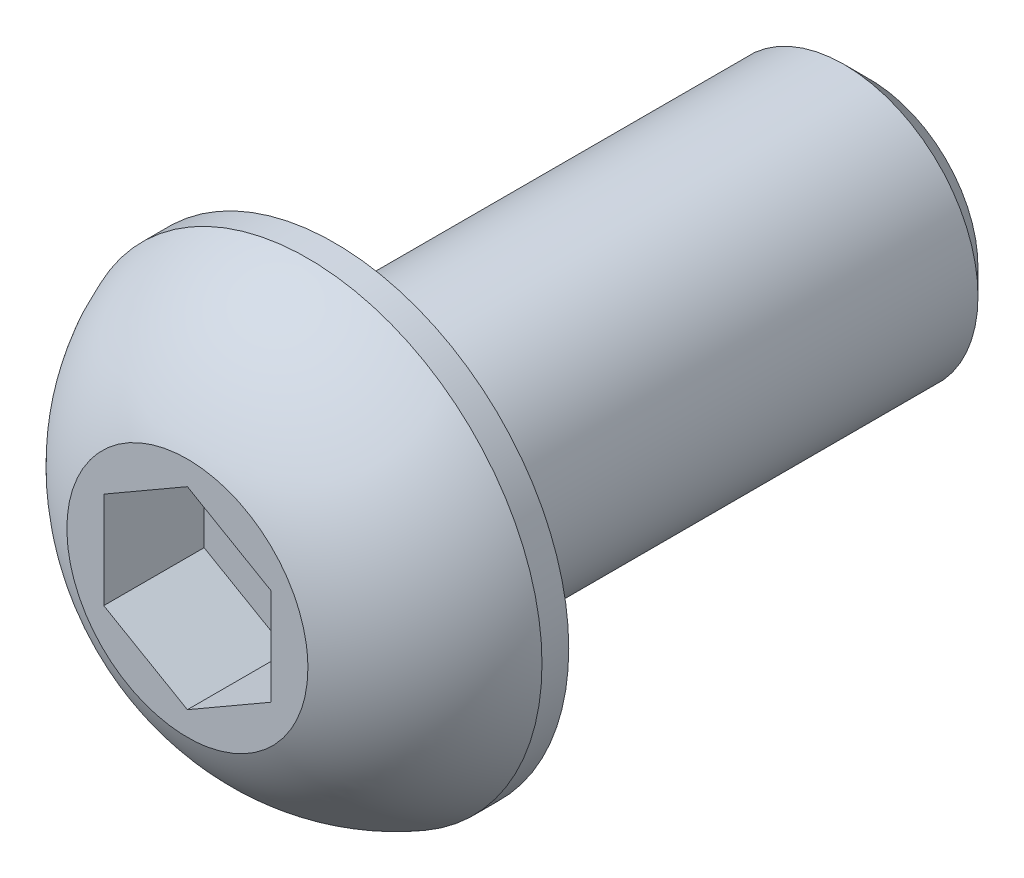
ISO-10303-21;
HEADER;
FILE_DESCRIPTION(('STEP AP214'),'2;1');
FILE_NAME('part.step','',(''),(''),'','','');
FILE_SCHEMA(('AUTOMOTIVE_DESIGN { 1 0 10303 214 1 1 1 1 }'));
ENDSEC;
DATA;
#1=APPLICATION_CONTEXT('core data for automotive mechanical design processes');
#2=APPLICATION_PROTOCOL_DEFINITION('international standard','automotive_design',2000,#1);
#3=PRODUCT_CONTEXT('',#1,'mechanical');
#4=PRODUCT('Part','Part','',(#3));
#5=PRODUCT_RELATED_PRODUCT_CATEGORY('part','',(#4));
#6=PRODUCT_DEFINITION_FORMATION('','',#4);
#7=PRODUCT_DEFINITION_CONTEXT('part definition',#1,'design');
#8=PRODUCT_DEFINITION('design','',#6,#7);
#9=PRODUCT_DEFINITION_SHAPE('','',#8);
#10=(LENGTH_UNIT() NAMED_UNIT(*) SI_UNIT(.MILLI.,.METRE.));
#11=(NAMED_UNIT(*) PLANE_ANGLE_UNIT() SI_UNIT($,.RADIAN.));
#12=(NAMED_UNIT(*) SI_UNIT($,.STERADIAN.) SOLID_ANGLE_UNIT());
#13=UNCERTAINTY_MEASURE_WITH_UNIT(LENGTH_MEASURE(1.E-05),#10,'distance_accuracy_value','');
#14=(GEOMETRIC_REPRESENTATION_CONTEXT(3) GLOBAL_UNCERTAINTY_ASSIGNED_CONTEXT((#13)) GLOBAL_UNIT_ASSIGNED_CONTEXT((#10,
#11,#12)) REPRESENTATION_CONTEXT('',''));
#15=CARTESIAN_POINT('',(0.,0.,0.));
#16=DIRECTION('',(0.,0.,1.));
#17=DIRECTION('',(1.,0.,0.));
#18=AXIS2_PLACEMENT_3D('',#15,#16,#17);
#19=CARTESIAN_POINT('',(0.,0.,1.4));
#20=DIRECTION('',(0.,0.,-1.));
#21=DIRECTION('',(-1.,0.,0.));
#22=AXIS2_PLACEMENT_3D('',#19,#20,#21);
#23=PLANE('',#22);
#24=DIRECTION('',(-0.866025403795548,0.499999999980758,0.));
#25=VECTOR('',#24,1.);
#26=CARTESIAN_POINT('',(1.25,2.16506350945,1.4));
#27=LINE('',#26,#25);
#28=CARTESIAN_POINT('',(2.5,1.443375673,1.4));
#29=VERTEX_POINT('',#28);
#30=CARTESIAN_POINT('',(0.,2.8867513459,1.4));
#31=VERTEX_POINT('',#30);
#32=EDGE_CURVE('E246',#29,#31,#27,.T.);
#33=ORIENTED_EDGE('',*,*,#32,.T.);
#34=DIRECTION('',(-0.866025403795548,-0.499999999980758,0.));
#35=VECTOR('',#34,1.);
#36=CARTESIAN_POINT('',(-1.25,2.16506350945,1.4));
#37=LINE('',#36,#35);
#38=CARTESIAN_POINT('',(-2.5,1.443375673,1.4));
#39=VERTEX_POINT('',#38);
#40=EDGE_CURVE('E251',#31,#39,#37,.T.);
#41=ORIENTED_EDGE('',*,*,#40,.T.);
#42=DIRECTION('',(0.,1.,0.));
#43=VECTOR('',#42,1.);
#44=CARTESIAN_POINT('',(-2.5,0.,1.4));
#45=LINE('',#44,#43);
#46=CARTESIAN_POINT('',(-2.5,-1.443375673,1.4));
#47=VERTEX_POINT('',#46);
#48=EDGE_CURVE('E256',#39,#47,#45,.F.);
#49=ORIENTED_EDGE('',*,*,#48,.T.);
#50=DIRECTION('',(0.866025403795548,-0.499999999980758,0.));
#51=VECTOR('',#50,1.);
#52=CARTESIAN_POINT('',(-1.25,-2.16506350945,1.4));
#53=LINE('',#52,#51);
#54=CARTESIAN_POINT('',(0.,-2.8867513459,1.4));
#55=VERTEX_POINT('',#54);
#56=EDGE_CURVE('E112',#47,#55,#53,.T.);
#57=ORIENTED_EDGE('',*,*,#56,.T.);
#58=DIRECTION('',(0.866025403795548,0.499999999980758,0.));
#59=VECTOR('',#58,1.);
#60=CARTESIAN_POINT('',(1.25,-2.16506350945,1.4));
#61=LINE('',#60,#59);
#62=CARTESIAN_POINT('',(2.5,-1.443375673,1.4));
#63=VERTEX_POINT('',#62);
#64=EDGE_CURVE('E96',#55,#63,#61,.T.);
#65=ORIENTED_EDGE('',*,*,#64,.T.);
#66=DIRECTION('',(0.,1.,0.));
#67=VECTOR('',#66,1.);
#68=CARTESIAN_POINT('',(2.5,0.7216878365,1.4));
#69=LINE('',#68,#67);
#70=EDGE_CURVE('E101',#63,#29,#69,.T.);
#71=ORIENTED_EDGE('',*,*,#70,.T.);
#72=EDGE_LOOP('',(#33,#41,#49,#57,#65,#71));
#73=FACE_BOUND('',#72,.T.);
#74=ADVANCED_FACE('F41',(#73),#23,.F.);
#75=CARTESIAN_POINT('',(2.5,0.7216878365,4.4));
#76=DIRECTION('',(1.,0.,0.));
#77=DIRECTION('',(0.,0.,-1.));
#78=AXIS2_PLACEMENT_3D('',#75,#76,#77);
#79=PLANE('',#78);
#80=DIRECTION('',(0.,0.,1.));
#81=VECTOR('',#80,1.);
#82=CARTESIAN_POINT('',(2.5,-1.443375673,4.4));
#83=LINE('',#82,#81);
#84=CARTESIAN_POINT('',(2.5,-1.443375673,4.39999999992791));
#85=VERTEX_POINT('',#84);
#86=EDGE_CURVE('E103',#63,#85,#83,.T.);
#87=ORIENTED_EDGE('',*,*,#86,.T.);
#88=DIRECTION('',(0.,1.,0.));
#89=VECTOR('',#88,1.);
#90=CARTESIAN_POINT('',(2.5,0.,4.39999999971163));
#91=LINE('',#90,#89);
#92=CARTESIAN_POINT('',(2.5,1.443375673,4.39999999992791));
#93=VERTEX_POINT('',#92);
#94=EDGE_CURVE('E244',#93,#85,#91,.F.);
#95=ORIENTED_EDGE('',*,*,#94,.F.);
#96=DIRECTION('',(0.,0.,1.));
#97=VECTOR('',#96,1.);
#98=CARTESIAN_POINT('',(2.5,1.443375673,4.4));
#99=LINE('',#98,#97);
#100=EDGE_CURVE('E106',#93,#29,#99,.F.);
#101=ORIENTED_EDGE('',*,*,#100,.T.);
#102=ORIENTED_EDGE('',*,*,#70,.F.);
#103=EDGE_LOOP('',(#87,#95,#101,#102));
#104=FACE_BOUND('',#103,.T.);
#105=ADVANCED_FACE('F102',(#104),#79,.F.);
#106=CARTESIAN_POINT('',(1.25,-2.16506350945,4.4));
#107=DIRECTION('',(0.499999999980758,-0.866025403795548,0.));
#108=DIRECTION('',(0.866025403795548,0.499999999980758,0.));
#109=AXIS2_PLACEMENT_3D('',#106,#107,#108);
#110=PLANE('',#109);
#111=DIRECTION('',(0.,0.,1.));
#112=VECTOR('',#111,1.);
#113=CARTESIAN_POINT('',(0.,-2.8867513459,4.4));
#114=LINE('',#113,#112);
#115=CARTESIAN_POINT('',(0.,-2.8867513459,4.39999999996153));
#116=VERTEX_POINT('',#115);
#117=EDGE_CURVE('E114',#55,#116,#114,.T.);
#118=ORIENTED_EDGE('',*,*,#117,.T.);
#119=DIRECTION('',(-0.866025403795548,-0.499999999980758,4.65924845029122E-11));
#120=VECTOR('',#119,1.);
#121=CARTESIAN_POINT('',(2.5,-1.443375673,4.39999999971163));
#122=LINE('',#121,#120);
#123=EDGE_CURVE('E118',#85,#116,#122,.T.);
#124=ORIENTED_EDGE('',*,*,#123,.F.);
#125=ORIENTED_EDGE('',*,*,#86,.F.);
#126=ORIENTED_EDGE('',*,*,#64,.F.);
#127=EDGE_LOOP('',(#118,#124,#125,#126));
#128=FACE_BOUND('',#127,.T.);
#129=ADVANCED_FACE('F116',(#128),#110,.F.);
#130=CARTESIAN_POINT('',(-1.25,-2.16506350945,4.4));
#131=DIRECTION('',(-0.499999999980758,-0.866025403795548,0.));
#132=DIRECTION('',(0.866025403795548,-0.499999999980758,0.));
#133=AXIS2_PLACEMENT_3D('',#130,#131,#132);
#134=PLANE('',#133);
#135=DIRECTION('',(0.,0.,1.));
#136=VECTOR('',#135,1.);
#137=CARTESIAN_POINT('',(-2.5,-1.443375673,4.4));
#138=LINE('',#137,#136);
#139=CARTESIAN_POINT('',(-2.5,-1.443375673,4.39999999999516));
#140=VERTEX_POINT('',#139);
#141=EDGE_CURVE('E258',#47,#140,#138,.T.);
#142=ORIENTED_EDGE('',*,*,#141,.T.);
#143=DIRECTION('',(-0.866025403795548,0.499999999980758,4.65924845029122E-11));
#144=VECTOR('',#143,1.);
#145=CARTESIAN_POINT('',(0.,-2.8867513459,4.39999999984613));
#146=LINE('',#145,#144);
#147=EDGE_CURVE('E240',#116,#140,#146,.T.);
#148=ORIENTED_EDGE('',*,*,#147,.F.);
#149=ORIENTED_EDGE('',*,*,#117,.F.);
#150=ORIENTED_EDGE('',*,*,#56,.F.);
#151=EDGE_LOOP('',(#142,#148,#149,#150));
#152=FACE_BOUND('',#151,.T.);
#153=ADVANCED_FACE('F158',(#152),#134,.F.);
#154=CARTESIAN_POINT('',(-2.5,0.,4.4));
#155=DIRECTION('',(-1.,0.,0.));
#156=DIRECTION('',(0.,0.,1.));
#157=AXIS2_PLACEMENT_3D('',#154,#155,#156);
#158=PLANE('',#157);
#159=DIRECTION('',(0.,0.,1.));
#160=VECTOR('',#159,1.);
#161=CARTESIAN_POINT('',(-2.5,1.443375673,4.4));
#162=LINE('',#161,#160);
#163=CARTESIAN_POINT('',(-2.5,1.443375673,4.39999999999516));
#164=VERTEX_POINT('',#163);
#165=EDGE_CURVE('E254',#39,#164,#162,.T.);
#166=ORIENTED_EDGE('',*,*,#165,.T.);
#167=DIRECTION('',(0.,1.,0.));
#168=VECTOR('',#167,1.);
#169=CARTESIAN_POINT('',(-2.5,0.,4.39999999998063));
#170=LINE('',#169,#168);
#171=EDGE_CURVE('E237',#140,#164,#170,.T.);
#172=ORIENTED_EDGE('',*,*,#171,.F.);
#173=ORIENTED_EDGE('',*,*,#141,.F.);
#174=ORIENTED_EDGE('',*,*,#48,.F.);
#175=EDGE_LOOP('',(#166,#172,#173,#174));
#176=FACE_BOUND('',#175,.T.);
#177=ADVANCED_FACE('F154',(#176),#158,.F.);
#178=CARTESIAN_POINT('',(-1.25,2.16506350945,4.4));
#179=DIRECTION('',(-0.499999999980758,0.866025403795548,0.));
#180=DIRECTION('',(-0.866025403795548,-0.499999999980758,0.));
#181=AXIS2_PLACEMENT_3D('',#178,#179,#180);
#182=PLANE('',#181);
#183=DIRECTION('',(0.,0.,1.));
#184=VECTOR('',#183,1.);
#185=CARTESIAN_POINT('',(0.,2.8867513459,4.4));
#186=LINE('',#185,#184);
#187=CARTESIAN_POINT('',(0.,2.8867513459,4.39999999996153));
#188=VERTEX_POINT('',#187);
#189=EDGE_CURVE('E249',#31,#188,#186,.T.);
#190=ORIENTED_EDGE('',*,*,#189,.T.);
#191=DIRECTION('',(0.866025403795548,0.499999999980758,-4.65924845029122E-11));
#192=VECTOR('',#191,1.);
#193=CARTESIAN_POINT('',(-2.5,1.443375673,4.39999999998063));
#194=LINE('',#193,#192);
#195=EDGE_CURVE('E234',#164,#188,#194,.T.);
#196=ORIENTED_EDGE('',*,*,#195,.F.);
#197=ORIENTED_EDGE('',*,*,#165,.F.);
#198=ORIENTED_EDGE('',*,*,#40,.F.);
#199=EDGE_LOOP('',(#190,#196,#197,#198));
#200=FACE_BOUND('',#199,.T.);
#201=ADVANCED_FACE('F150',(#200),#182,.F.);
#202=CARTESIAN_POINT('',(1.25,2.16506350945,4.4));
#203=DIRECTION('',(0.499999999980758,0.866025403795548,0.));
#204=DIRECTION('',(-0.866025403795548,0.499999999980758,0.));
#205=AXIS2_PLACEMENT_3D('',#202,#203,#204);
#206=PLANE('',#205);
#207=ORIENTED_EDGE('',*,*,#100,.F.);
#208=DIRECTION('',(0.866025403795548,-0.499999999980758,-4.65924845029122E-11));
#209=VECTOR('',#208,1.);
#210=CARTESIAN_POINT('',(0.,2.8867513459,4.39999999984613));
#211=LINE('',#210,#209);
#212=EDGE_CURVE('E136',#188,#93,#211,.T.);
#213=ORIENTED_EDGE('',*,*,#212,.F.);
#214=ORIENTED_EDGE('',*,*,#189,.F.);
#215=ORIENTED_EDGE('',*,*,#32,.F.);
#216=EDGE_LOOP('',(#207,#213,#214,#215));
#217=FACE_BOUND('',#216,.T.);
#218=ADVANCED_FACE('F146',(#217),#206,.F.);
#219=CARTESIAN_POINT('',(-3.23151399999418,0.,4.40000000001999));
#220=DIRECTION('',(5.38003067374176E-11,0.,1.));
#221=DIRECTION('',(1.,0.,-5.38003067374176E-11));
#222=AXIS2_PLACEMENT_3D('',#219,#220,#221);
#223=PLANE('',#222);
#224=CARTESIAN_POINT('',(3.60302800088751,0.,4.39999999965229));
#225=CARTESIAN_POINT('',(3.60302739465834,-0.101161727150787,4.39999999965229));
#226=CARTESIAN_POINT('',(3.59876373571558,-0.202342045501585,4.39999999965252));
#227=CARTESIAN_POINT('',(3.5817368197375,-0.404003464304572,4.39999999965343));
#228=CARTESIAN_POINT('',(3.56897105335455,-0.504484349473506,4.39999999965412));
#229=CARTESIAN_POINT('',(3.53499735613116,-0.704182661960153,4.39999999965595));
#230=CARTESIAN_POINT('',(3.51377602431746,-0.803397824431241,4.39999999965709));
#231=CARTESIAN_POINT('',(3.46303747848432,-0.999742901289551,4.39999999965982));
#232=CARTESIAN_POINT('',(3.43351353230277,-1.0968710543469,4.39999999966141));
#233=CARTESIAN_POINT('',(3.33289595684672,-1.38366869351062,4.39999999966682));
#234=CARTESIAN_POINT('',(3.2496739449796,-1.56923401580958,4.3999999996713));
#235=CARTESIAN_POINT('',(3.05321325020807,-1.92373837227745,4.39999999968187));
#236=CARTESIAN_POINT('',(2.93997342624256,-2.09267677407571,4.39999999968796));
#237=CARTESIAN_POINT('',(2.7501783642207,-2.3299437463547,4.39999999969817));
#238=CARTESIAN_POINT('',(2.68354067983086,-2.40638732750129,4.39999999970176));
#239=CARTESIAN_POINT('',(2.54411499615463,-2.55333638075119,4.39999999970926));
#240=CARTESIAN_POINT('',(2.47133298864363,-2.62384750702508,4.39999999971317));
#241=CARTESIAN_POINT('',(2.32005283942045,-2.75851860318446,4.39999999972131));
#242=CARTESIAN_POINT('',(2.2415521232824,-2.82267568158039,4.39999999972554));
#243=CARTESIAN_POINT('',(2.07943216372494,-2.94415515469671,4.39999999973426));
#244=CARTESIAN_POINT('',(1.9958117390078,-3.00147596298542,4.39999999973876));
#245=CARTESIAN_POINT('',(1.73818269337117,-3.16250597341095,4.39999999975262));
#246=CARTESIAN_POINT('',(1.5572464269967,-3.25542481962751,4.39999999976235));
#247=CARTESIAN_POINT('',(1.18243980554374,-3.40951047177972,4.39999999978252));
#248=CARTESIAN_POINT('',(0.988569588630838,-3.47067761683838,4.39999999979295));
#249=CARTESIAN_POINT('',(0.593286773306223,-3.55961210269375,4.39999999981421));
#250=CARTESIAN_POINT('',(0.391874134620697,-3.58737926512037,4.39999999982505));
#251=CARTESIAN_POINT('',(-0.0127538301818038,-3.60869681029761,4.39999999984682));
#252=CARTESIAN_POINT('',(-0.21596915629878,-3.60224719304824,4.39999999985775));
#253=CARTESIAN_POINT('',(-0.618408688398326,-3.55534015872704,4.3999999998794));
#254=CARTESIAN_POINT('',(-0.817632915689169,-3.51488292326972,4.39999999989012));
#255=CARTESIAN_POINT('',(-1.20655549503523,-3.40103381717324,4.39999999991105));
#256=CARTESIAN_POINT('',(-1.39625374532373,-3.3276415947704,4.39999999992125));
#257=CARTESIAN_POINT('',(-1.66937712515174,-3.19457390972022,4.39999999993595));
#258=CARTESIAN_POINT('',(-1.75855773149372,-3.14635700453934,4.39999999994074));
#259=CARTESIAN_POINT('',(-1.93254490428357,-3.04258510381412,4.3999999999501));
#260=CARTESIAN_POINT('',(-2.01735247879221,-2.98703181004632,4.39999999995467));
#261=CARTESIAN_POINT('',(-2.18194598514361,-2.86900229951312,4.39999999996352));
#262=CARTESIAN_POINT('',(-2.26173417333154,-2.80652922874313,4.39999999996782));
#263=CARTESIAN_POINT('',(-2.41582896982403,-2.67504409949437,4.39999999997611));
#264=CARTESIAN_POINT('',(-2.49013021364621,-2.60602578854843,4.3999999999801));
#265=CARTESIAN_POINT('',(-2.70380588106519,-2.39001539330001,4.3999999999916));
#266=CARTESIAN_POINT('',(-2.83417035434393,-2.23391111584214,4.39999999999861));
#267=CARTESIAN_POINT('',(-3.0667937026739,-1.90201275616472,4.40000000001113));
#268=CARTESIAN_POINT('',(-3.16905364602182,-1.7262194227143,4.40000000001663));
#269=CARTESIAN_POINT('',(-3.29925003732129,-1.45158205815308,4.40000000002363));
#270=CARTESIAN_POINT('',(-3.3388164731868,-1.35809388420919,4.40000000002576));
#271=CARTESIAN_POINT('',(-3.40990547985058,-1.16816720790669,4.40000000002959));
#272=CARTESIAN_POINT('',(-3.44143456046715,-1.07173116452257,4.40000000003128));
#273=CARTESIAN_POINT('',(-3.49620387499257,-0.876708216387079,4.40000000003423));
#274=CARTESIAN_POINT('',(-3.51945719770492,-0.778124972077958,4.40000000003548));
#275=CARTESIAN_POINT('',(-3.5575798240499,-0.579369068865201,4.40000000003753));
#276=CARTESIAN_POINT('',(-3.57245160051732,-0.479196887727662,4.40000000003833));
#277=CARTESIAN_POINT('',(-3.58972538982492,-0.3157245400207,4.40000000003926));
#278=CARTESIAN_POINT('',(-3.59471229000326,-0.252686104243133,4.40000000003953));
#279=CARTESIAN_POINT('',(-3.60136378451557,-0.12643419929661,4.40000000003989));
#280=CARTESIAN_POINT('',(-3.60302837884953,-0.0632207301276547,4.40000000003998));
#281=CARTESIAN_POINT('',(-3.60302739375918,0.101161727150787,4.40000000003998));
#282=CARTESIAN_POINT('',(-3.59876373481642,0.202342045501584,4.40000000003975));
#283=CARTESIAN_POINT('',(-3.58173681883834,0.40400346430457,4.40000000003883));
#284=CARTESIAN_POINT('',(-3.56897105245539,0.504484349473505,4.40000000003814));
#285=CARTESIAN_POINT('',(-3.534997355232,0.704182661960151,4.40000000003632));
#286=CARTESIAN_POINT('',(-3.5137760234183,0.803397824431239,4.40000000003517));
#287=CARTESIAN_POINT('',(-3.46303747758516,0.99974290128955,4.40000000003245));
#288=CARTESIAN_POINT('',(-3.43351353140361,1.0968710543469,4.40000000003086));
#289=CARTESIAN_POINT('',(-3.33289595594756,1.38366869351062,4.40000000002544));
#290=CARTESIAN_POINT('',(-3.24967394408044,1.56923401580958,4.40000000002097));
#291=CARTESIAN_POINT('',(-3.05321324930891,1.92373837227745,4.4000000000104));
#292=CARTESIAN_POINT('',(-2.93997342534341,2.09267677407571,4.4000000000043));
#293=CARTESIAN_POINT('',(-2.75017836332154,2.3299437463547,4.39999999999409));
#294=CARTESIAN_POINT('',(-2.6835406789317,2.40638732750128,4.39999999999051));
#295=CARTESIAN_POINT('',(-2.54411499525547,2.55333638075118,4.39999999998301));
#296=CARTESIAN_POINT('',(-2.47133298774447,2.62384750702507,4.39999999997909));
#297=CARTESIAN_POINT('',(-2.3200528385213,2.75851860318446,4.39999999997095));
#298=CARTESIAN_POINT('',(-2.24155212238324,2.82267568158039,4.39999999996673));
#299=CARTESIAN_POINT('',(-2.07943216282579,2.94415515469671,4.39999999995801));
#300=CARTESIAN_POINT('',(-1.99581173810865,3.00147596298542,4.39999999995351));
#301=CARTESIAN_POINT('',(-1.73818269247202,3.16250597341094,4.39999999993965));
#302=CARTESIAN_POINT('',(-1.55724642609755,3.2554248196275,4.39999999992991));
#303=CARTESIAN_POINT('',(-1.18243980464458,3.40951047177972,4.39999999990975));
#304=CARTESIAN_POINT('',(-0.988569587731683,3.47067761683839,4.39999999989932));
#305=CARTESIAN_POINT('',(-0.593286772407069,3.55961210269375,4.39999999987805));
#306=CARTESIAN_POINT('',(-0.391874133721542,3.58737926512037,4.39999999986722));
#307=CARTESIAN_POINT('',(0.0127538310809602,3.60869681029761,4.39999999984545));
#308=CARTESIAN_POINT('',(0.215969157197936,3.60224719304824,4.39999999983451));
#309=CARTESIAN_POINT('',(0.618408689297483,3.55534015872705,4.39999999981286));
#310=CARTESIAN_POINT('',(0.817632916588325,3.51488292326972,4.39999999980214));
#311=CARTESIAN_POINT('',(1.20655549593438,3.40103381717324,4.39999999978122));
#312=CARTESIAN_POINT('',(1.39625374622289,3.32764159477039,4.39999999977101));
#313=CARTESIAN_POINT('',(1.66937712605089,3.19457390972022,4.39999999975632));
#314=CARTESIAN_POINT('',(1.75855773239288,3.14635700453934,4.39999999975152));
#315=CARTESIAN_POINT('',(1.93254490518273,3.04258510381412,4.39999999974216));
#316=CARTESIAN_POINT('',(2.01735247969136,2.98703181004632,4.3999999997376));
#317=CARTESIAN_POINT('',(2.18194598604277,2.86900229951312,4.39999999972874));
#318=CARTESIAN_POINT('',(2.2617341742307,2.80652922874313,4.39999999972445));
#319=CARTESIAN_POINT('',(2.41582897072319,2.67504409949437,4.39999999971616));
#320=CARTESIAN_POINT('',(2.49013021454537,2.60602578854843,4.39999999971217));
#321=CARTESIAN_POINT('',(2.70380588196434,2.39001539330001,4.39999999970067));
#322=CARTESIAN_POINT('',(2.83417035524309,2.23391111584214,4.39999999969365));
#323=CARTESIAN_POINT('',(3.06679370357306,1.90201275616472,4.39999999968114));
#324=CARTESIAN_POINT('',(3.16905364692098,1.7262194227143,4.39999999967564));
#325=CARTESIAN_POINT('',(3.29925003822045,1.45158205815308,4.39999999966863));
#326=CARTESIAN_POINT('',(3.33881647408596,1.35809388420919,4.3999999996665));
#327=CARTESIAN_POINT('',(3.40990548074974,1.16816720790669,4.39999999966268));
#328=CARTESIAN_POINT('',(3.44143456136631,1.07173116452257,4.39999999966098));
#329=CARTESIAN_POINT('',(3.49620387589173,0.876708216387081,4.39999999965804));
#330=CARTESIAN_POINT('',(3.51945719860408,0.77812497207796,4.39999999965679));
#331=CARTESIAN_POINT('',(3.55757982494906,0.579369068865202,4.39999999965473));
#332=CARTESIAN_POINT('',(3.57245160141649,0.479196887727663,4.39999999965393));
#333=CARTESIAN_POINT('',(3.58972539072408,0.3157245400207,4.399999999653));
#334=CARTESIAN_POINT('',(3.59471229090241,0.252686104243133,4.39999999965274));
#335=CARTESIAN_POINT('',(3.60136378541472,0.12643419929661,4.39999999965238));
#336=CARTESIAN_POINT('',(3.60302837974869,0.0632207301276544,4.39999999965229));
#337=CARTESIAN_POINT('',(3.60302800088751,0.,4.39999999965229));
#338=B_SPLINE_CURVE_WITH_KNOTS('',3,(#224,#225,#226,#227,#228,#229,#230,#231,#232,#233,#234,
#235,#236,#237,#238,#239,#240,#241,#242,#243,#244,#245,#246,#247,#248,#249,#250,#251,#252,#253,
#254,#255,#256,#257,#258,#259,#260,#261,#262,#263,#264,#265,#266,#267,#268,#269,#270,#271,#272,
#273,#274,#275,#276,#277,#278,#279,#280,#281,#282,#283,#284,#285,#286,#287,#288,#289,#290,#291,
#292,#293,#294,#295,#296,#297,#298,#299,#300,#301,#302,#303,#304,#305,#306,#307,#308,#309,#310,
#311,#312,#313,#314,#315,#316,#317,#318,#319,#320,#321,#322,#323,#324,#325,#326,#327,#328,#329,
#330,#331,#332,#333,#334,#335,#336,#337),.UNSPECIFIED.,.T.,.F.,(4,2,2,2,2,2,2,2,2,2,2,2,2,2,2,2,
2,2,2,2,2,2,2,2,2,2,2,2,2,2,2,2,2,2,2,2,2,2,2,2,2,2,2,2,2,2,2,2,2,2,2,2,2,2,2,2,4),(0.,
0.303426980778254,0.606943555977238,0.910943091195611,1.21518983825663,1.82223302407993,
2.42929928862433,2.73323016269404,3.03686800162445,3.34064338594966,3.64448912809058,
4.25154709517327,4.85859857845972,5.46565330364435,6.07270802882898,6.67975951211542,
7.28681747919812,7.59066322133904,7.89443860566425,8.19807644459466,8.50200731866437,
9.10907358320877,9.71611676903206,10.0203635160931,10.3243630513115,10.6278796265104,
10.9313066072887,11.1209324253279,11.3105582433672,11.6139852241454,11.9175017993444,
12.2215013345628,12.5257480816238,13.1327912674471,13.7398575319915,14.0437884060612,
14.3474262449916,14.6512016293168,14.9550473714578,15.5621053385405,16.1691568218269,
16.7762115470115,17.3832662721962,17.9903177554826,18.5973757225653,18.9012214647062,
19.2049968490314,19.5086346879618,19.8125655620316,20.4196318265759,21.0266750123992,
21.3309217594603,21.6349212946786,21.9384378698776,22.2418648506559,22.4314906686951,
22.6211164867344),.UNSPECIFIED.);
#339=CARTESIAN_POINT('',(3.60302800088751,0.,4.39999999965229));
#340=VERTEX_POINT('',#339);
#341=EDGE_CURVE('E128',#340,#340,#338,.T.);
#342=ORIENTED_EDGE('',*,*,#341,.F.);
#343=EDGE_LOOP('',(#342));
#344=FACE_BOUND('',#343,.T.);
#345=ORIENTED_EDGE('',*,*,#195,.T.);
#346=ORIENTED_EDGE('',*,*,#212,.T.);
#347=ORIENTED_EDGE('',*,*,#94,.T.);
#348=ORIENTED_EDGE('',*,*,#123,.T.);
#349=ORIENTED_EDGE('',*,*,#147,.T.);
#350=ORIENTED_EDGE('',*,*,#171,.T.);
#351=EDGE_LOOP('',(#345,#346,#347,#348,#349,#350));
#352=FACE_BOUND('',#351,.T.);
#353=ADVANCED_FACE('F142',(#344,#352),#223,.T.);
#354=CARTESIAN_POINT('',(1.129567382,0.,-1.3366627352));
#355=DIRECTION('',(0.,-1.,0.));
#356=DIRECTION('',(1.,0.,0.));
#357=AXIS2_PLACEMENT_3D('',#354,#355,#356);
#358=CIRCLE('',#357,6.2471839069);
#359=TRIMMED_CURVE('',#358,(PARAMETER_VALUE(-1.75260857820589)),
(PARAMETER_VALUE(1.75260857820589)),.T.,.PARAMETER.);
#360=CARTESIAN_POINT('',(0.,0.,-1.3366627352));
#361=DIRECTION('',(0.,0.,-1.));
#362=AXIS1_PLACEMENT('',#360,#361);
#363=SURFACE_OF_REVOLUTION('',#359,#362);
#364=ORIENTED_EDGE('',*,*,#341,.T.);
#365=EDGE_LOOP('',(#364));
#366=FACE_BOUND('',#365,.T.);
#367=CARTESIAN_POINT('',(0.,0.,0.8));
#368=DIRECTION('',(0.,0.,-1.));
#369=DIRECTION('',(-1.,0.,0.));
#370=AXIS2_PLACEMENT_3D('',#367,#368,#369);
#371=CIRCLE('',#370,7.);
#372=CARTESIAN_POINT('',(-7.,0.,0.8));
#373=VERTEX_POINT('',#372);
#374=EDGE_CURVE('E127',#373,#373,#371,.T.);
#375=ORIENTED_EDGE('',*,*,#374,.F.);
#376=EDGE_LOOP('',(#375));
#377=FACE_BOUND('',#376,.T.);
#378=ADVANCED_FACE('F138',(#366,#377),#363,.F.);
#379=CARTESIAN_POINT('',(0.,0.,0.399999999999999));
#380=DIRECTION('',(0.,0.,-1.));
#381=DIRECTION('',(-1.,0.,0.));
#382=AXIS2_PLACEMENT_3D('',#379,#380,#381);
#383=CYLINDRICAL_SURFACE('',#382,7.);
#384=CARTESIAN_POINT('',(0.,0.,0.));
#385=DIRECTION('',(0.,0.,-1.));
#386=DIRECTION('',(-1.,0.,0.));
#387=AXIS2_PLACEMENT_3D('',#384,#385,#386);
#388=CIRCLE('',#387,7.);
#389=CARTESIAN_POINT('',(-7.,0.,0.));
#390=VERTEX_POINT('',#389);
#391=EDGE_CURVE('E123',#390,#390,#388,.T.);
#392=ORIENTED_EDGE('',*,*,#391,.F.);
#393=EDGE_LOOP('',(#392));
#394=FACE_BOUND('',#393,.T.);
#395=ORIENTED_EDGE('',*,*,#374,.T.);
#396=EDGE_LOOP('',(#395));
#397=FACE_BOUND('',#396,.T.);
#398=ADVANCED_FACE('F179',(#394,#397),#383,.T.);
#399=CARTESIAN_POINT('',(-5.7,0.,0.));
#400=DIRECTION('',(0.,0.,-1.));
#401=DIRECTION('',(-1.,0.,0.));
#402=AXIS2_PLACEMENT_3D('',#399,#400,#401);
#403=PLANE('',#402);
#404=ORIENTED_EDGE('',*,*,#391,.T.);
#405=EDGE_LOOP('',(#404));
#406=FACE_BOUND('',#405,.T.);
#407=CARTESIAN_POINT('',(0.,0.,0.));
#408=DIRECTION('',(0.,0.,-1.));
#409=DIRECTION('',(-1.,0.,0.));
#410=AXIS2_PLACEMENT_3D('',#407,#408,#409);
#411=CIRCLE('',#410,4.4);
#412=CARTESIAN_POINT('',(4.4,0.,0.));
#413=VERTEX_POINT('',#412);
#414=CARTESIAN_POINT('',(-4.4,0.,0.));
#415=VERTEX_POINT('',#414);
#416=EDGE_CURVE('E57',#413,#415,#411,.F.);
#417=ORIENTED_EDGE('',*,*,#416,.T.);
#418=CARTESIAN_POINT('',(0.,0.,0.));
#419=DIRECTION('',(0.,0.,-1.));
#420=DIRECTION('',(1.,0.,0.));
#421=AXIS2_PLACEMENT_3D('',#418,#419,#420);
#422=CIRCLE('',#421,4.4);
#423=EDGE_CURVE('E126',#415,#413,#422,.F.);
#424=ORIENTED_EDGE('',*,*,#423,.T.);
#425=EDGE_LOOP('',(#417,#424));
#426=FACE_BOUND('',#425,.T.);
#427=ADVANCED_FACE('F171',(#406,#426),#403,.T.);
#428=CARTESIAN_POINT('',(-1.6166,0.,-16.));
#429=DIRECTION('',(0.,0.,-1.));
#430=DIRECTION('',(-1.,0.,0.));
#431=AXIS2_PLACEMENT_3D('',#428,#429,#430);
#432=PLANE('',#431);
#433=CARTESIAN_POINT('',(0.,0.,-15.9999999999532));
#434=DIRECTION('',(0.,0.,1.));
#435=DIRECTION('',(0.,-1.,0.));
#436=AXIS2_PLACEMENT_3D('',#433,#434,#435);
#437=CIRCLE('',#436,3.23320000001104);
#438=CARTESIAN_POINT('',(0.,-3.23320000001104,-15.9999999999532));
#439=VERTEX_POINT('',#438);
#440=EDGE_CURVE('E226',#439,#439,#437,.T.);
#441=ORIENTED_EDGE('',*,*,#440,.F.);
#442=EDGE_LOOP('',(#441));
#443=FACE_BOUND('',#442,.T.);
#444=ADVANCED_FACE('F168',(#443),#432,.T.);
#445=CARTESIAN_POINT('',(0.,0.,-0.4));
#446=DIRECTION('',(0.,0.,-1.));
#447=DIRECTION('',(1.,0.,0.));
#448=AXIS2_PLACEMENT_3D('',#445,#446,#447);
#449=TOROIDAL_SURFACE('',#448,4.4,0.400000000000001);
#450=ORIENTED_EDGE('',*,*,#416,.F.);
#451=ORIENTED_EDGE('',*,*,#423,.F.);
#452=EDGE_LOOP('',(#450,#451));
#453=FACE_BOUND('',#452,.T.);
#454=CARTESIAN_POINT('',(0.,0.,-0.4));
#455=DIRECTION('',(0.,0.,-1.));
#456=DIRECTION('',(-1.,0.,0.));
#457=AXIS2_PLACEMENT_3D('',#454,#455,#456);
#458=CIRCLE('',#457,4.);
#459=CARTESIAN_POINT('',(-4.,0.,-0.4));
#460=VERTEX_POINT('',#459);
#461=EDGE_CURVE('E50',#460,#460,#458,.T.);
#462=ORIENTED_EDGE('',*,*,#461,.F.);
#463=EDGE_LOOP('',(#462));
#464=FACE_BOUND('',#463,.T.);
#465=ADVANCED_FACE('F170',(#453,#464),#449,.F.);
#466=CARTESIAN_POINT('',(0.,0.,-15.2332000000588));
#467=DIRECTION('',(0.,0.,1.));
#468=DIRECTION('',(0.,-1.,0.));
#469=AXIS2_PLACEMENT_3D('',#466,#467,#468);
#470=CONICAL_SURFACE('',#469,3.99999999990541,0.785398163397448);
#471=ORIENTED_EDGE('',*,*,#440,.T.);
#472=EDGE_LOOP('',(#471));
#473=FACE_BOUND('',#472,.T.);
#474=CARTESIAN_POINT('',(0.,0.,-15.2332));
#475=DIRECTION('',(0.,0.,-1.));
#476=DIRECTION('',(-1.,0.,0.));
#477=AXIS2_PLACEMENT_3D('',#474,#475,#476);
#478=CIRCLE('',#477,4.);
#479=CARTESIAN_POINT('',(-4.,0.,-15.2332));
#480=VERTEX_POINT('',#479);
#481=EDGE_CURVE('E14',#480,#480,#478,.F.);
#482=ORIENTED_EDGE('',*,*,#481,.F.);
#483=EDGE_LOOP('',(#482));
#484=FACE_BOUND('',#483,.T.);
#485=ADVANCED_FACE('F43',(#473,#484),#470,.T.);
#486=CARTESIAN_POINT('',(0.,0.,-6.8166));
#487=DIRECTION('',(0.,0.,-1.));
#488=DIRECTION('',(-1.,0.,0.));
#489=AXIS2_PLACEMENT_3D('',#486,#487,#488);
#490=CYLINDRICAL_SURFACE('',#489,4.);
#491=ORIENTED_EDGE('',*,*,#461,.T.);
#492=EDGE_LOOP('',(#491));
#493=FACE_BOUND('',#492,.T.);
#494=ORIENTED_EDGE('',*,*,#481,.T.);
#495=EDGE_LOOP('',(#494));
#496=FACE_BOUND('',#495,.T.);
#497=ADVANCED_FACE('F183',(#493,#496),#490,.T.);
#498=CLOSED_SHELL('',(#74,#105,#129,#153,#177,#201,#218,#353,#378,#398,#427,#444,#465,#485,#497));
#499=MANIFOLD_SOLID_BREP('B2',#498);
#500=ADVANCED_BREP_SHAPE_REPRESENTATION('',(#18,#499),#14);
#501=SHAPE_DEFINITION_REPRESENTATION(#9,#500);
ENDSEC;
END-ISO-10303-21;
